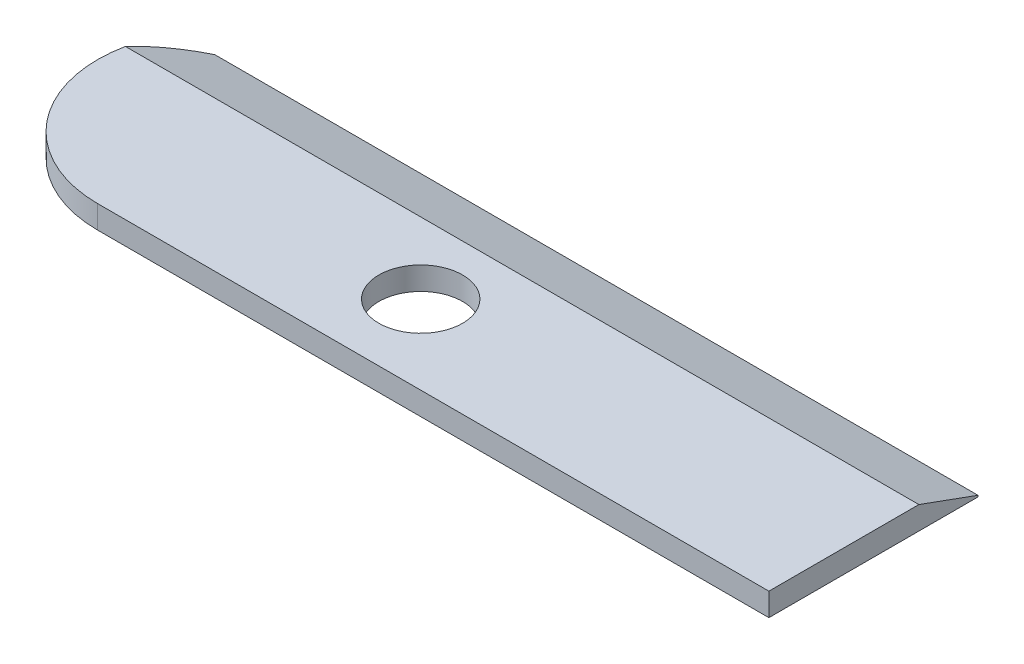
ISO-10303-21;
HEADER;
FILE_DESCRIPTION(('STEP AP214'),'2;1');
FILE_NAME('part.step','',(''),(''),'','','');
FILE_SCHEMA(('AUTOMOTIVE_DESIGN { 1 0 10303 214 1 1 1 1 }'));
ENDSEC;
DATA;
#1=APPLICATION_CONTEXT('core data for automotive mechanical design processes');
#2=APPLICATION_PROTOCOL_DEFINITION('international standard','automotive_design',2000,#1);
#3=PRODUCT_CONTEXT('',#1,'mechanical');
#4=PRODUCT('Part','Part','',(#3));
#5=PRODUCT_RELATED_PRODUCT_CATEGORY('part','',(#4));
#6=PRODUCT_DEFINITION_FORMATION('','',#4);
#7=PRODUCT_DEFINITION_CONTEXT('part definition',#1,'design');
#8=PRODUCT_DEFINITION('design','',#6,#7);
#9=PRODUCT_DEFINITION_SHAPE('','',#8);
#10=(LENGTH_UNIT() NAMED_UNIT(*) SI_UNIT(.MILLI.,.METRE.));
#11=(NAMED_UNIT(*) PLANE_ANGLE_UNIT() SI_UNIT($,.RADIAN.));
#12=(NAMED_UNIT(*) SI_UNIT($,.STERADIAN.) SOLID_ANGLE_UNIT());
#13=UNCERTAINTY_MEASURE_WITH_UNIT(LENGTH_MEASURE(1.E-05),#10,'distance_accuracy_value','');
#14=(GEOMETRIC_REPRESENTATION_CONTEXT(3) GLOBAL_UNCERTAINTY_ASSIGNED_CONTEXT((#13)) GLOBAL_UNIT_ASSIGNED_CONTEXT((#10,
#11,#12)) REPRESENTATION_CONTEXT('',''));
#15=CARTESIAN_POINT('',(0.,0.,0.));
#16=DIRECTION('',(0.,0.,1.));
#17=DIRECTION('',(1.,0.,0.));
#18=AXIS2_PLACEMENT_3D('',#15,#16,#17);
#19=CARTESIAN_POINT('',(-35.4774391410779,0.7,-18.245962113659));
#20=DIRECTION('',(0.,1.,0.));
#21=DIRECTION('',(0.,0.,1.));
#22=AXIS2_PLACEMENT_3D('',#19,#20,#21);
#23=PLANE('',#22);
#24=DIRECTION('',(0.,0.,-1.));
#25=VECTOR('',#24,1.);
#26=CARTESIAN_POINT('',(-15.0426007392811,0.7,-20.8124043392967));
#27=LINE('',#26,#25);
#28=CARTESIAN_POINT('',(-15.0426007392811,0.7,-14.445962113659));
#29=VERTEX_POINT('',#28);
#30=CARTESIAN_POINT('',(-15.0426007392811,0.7,-19.0124043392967));
#31=VERTEX_POINT('',#30);
#32=EDGE_CURVE('E95',#29,#31,#27,.T.);
#33=ORIENTED_EDGE('',*,*,#32,.T.);
#34=DIRECTION('',(-1.,0.,0.));
#35=VECTOR('',#34,1.);
#36=CARTESIAN_POINT('',(-38.2798263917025,0.7,-19.0124043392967));
#37=LINE('',#36,#35);
#38=CARTESIAN_POINT('',(-39.1993427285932,0.7,-19.0124043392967));
#39=VERTEX_POINT('',#38);
#40=EDGE_CURVE('E83',#31,#39,#37,.T.);
#41=ORIENTED_EDGE('',*,*,#40,.T.);
#42=CARTESIAN_POINT('',(-35.4774391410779,0.7,-18.245962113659));
#43=DIRECTION('',(0.,1.,0.));
#44=DIRECTION('',(0.,0.,1.));
#45=AXIS2_PLACEMENT_3D('',#42,#43,#44);
#46=CIRCLE('',#45,3.8);
#47=CARTESIAN_POINT('',(-35.4774391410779,0.7,-14.445962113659));
#48=VERTEX_POINT('',#47);
#49=EDGE_CURVE('E76',#39,#48,#46,.T.);
#50=ORIENTED_EDGE('',*,*,#49,.T.);
#51=DIRECTION('',(1.,0.,0.));
#52=VECTOR('',#51,1.);
#53=CARTESIAN_POINT('',(-35.4774391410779,0.7,-14.445962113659));
#54=LINE('',#53,#52);
#55=EDGE_CURVE('E80',#48,#29,#54,.T.);
#56=ORIENTED_EDGE('',*,*,#55,.T.);
#57=EDGE_LOOP('',(#33,#41,#50,#56));
#58=FACE_BOUND('',#57,.T.);
#59=CARTESIAN_POINT('',(-28.0426007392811,0.7,-16.845962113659));
#60=DIRECTION('',(0.,1.,0.));
#61=DIRECTION('',(0.,0.,1.));
#62=AXIS2_PLACEMENT_3D('',#59,#60,#61);
#63=CIRCLE('',#62,1.275);
#64=CARTESIAN_POINT('',(-28.0426007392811,0.7,-15.570962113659));
#65=VERTEX_POINT('',#64);
#66=EDGE_CURVE('E117',#65,#65,#63,.T.);
#67=ORIENTED_EDGE('',*,*,#66,.F.);
#68=EDGE_LOOP('',(#67));
#69=FACE_BOUND('',#68,.T.);
#70=ADVANCED_FACE('F32',(#58,#69),#23,.T.);
#71=CARTESIAN_POINT('',(-35.4774391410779,0.,-18.245962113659));
#72=DIRECTION('',(0.,1.,0.));
#73=DIRECTION('',(0.,0.,1.));
#74=AXIS2_PLACEMENT_3D('',#71,#72,#73);
#75=PLANE('',#74);
#76=CARTESIAN_POINT('',(-35.4774391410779,0.,-18.245962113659));
#77=DIRECTION('',(0.,1.,0.));
#78=DIRECTION('',(0.,0.,1.));
#79=AXIS2_PLACEMENT_3D('',#76,#77,#78);
#80=CIRCLE('',#79,3.8);
#81=CARTESIAN_POINT('',(-38.2798263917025,0.,-20.8124043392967));
#82=VERTEX_POINT('',#81);
#83=CARTESIAN_POINT('',(-35.4774391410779,0.,-14.445962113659));
#84=VERTEX_POINT('',#83);
#85=EDGE_CURVE('E99',#82,#84,#80,.T.);
#86=ORIENTED_EDGE('',*,*,#85,.F.);
#87=DIRECTION('',(-1.,0.,0.));
#88=VECTOR('',#87,1.);
#89=CARTESIAN_POINT('',(-15.0426007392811,0.,-20.8124043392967));
#90=LINE('',#89,#88);
#91=CARTESIAN_POINT('',(-15.0426007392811,0.,-20.8124043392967));
#92=VERTEX_POINT('',#91);
#93=EDGE_CURVE('E85',#92,#82,#90,.T.);
#94=ORIENTED_EDGE('',*,*,#93,.F.);
#95=DIRECTION('',(0.,0.,-1.));
#96=VECTOR('',#95,1.);
#97=CARTESIAN_POINT('',(-15.0426007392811,0.,-20.8124043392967));
#98=LINE('',#97,#96);
#99=CARTESIAN_POINT('',(-15.0426007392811,0.,-14.445962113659));
#100=VERTEX_POINT('',#99);
#101=EDGE_CURVE('E111',#100,#92,#98,.T.);
#102=ORIENTED_EDGE('',*,*,#101,.F.);
#103=DIRECTION('',(1.,0.,0.));
#104=VECTOR('',#103,1.);
#105=CARTESIAN_POINT('',(-35.4774391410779,0.,-14.445962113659));
#106=LINE('',#105,#104);
#107=EDGE_CURVE('E114',#84,#100,#106,.T.);
#108=ORIENTED_EDGE('',*,*,#107,.F.);
#109=EDGE_LOOP('',(#86,#94,#102,#108));
#110=FACE_BOUND('',#109,.T.);
#111=CARTESIAN_POINT('',(-28.0426007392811,0.,-16.845962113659));
#112=DIRECTION('',(0.,1.,0.));
#113=DIRECTION('',(0.,0.,1.));
#114=AXIS2_PLACEMENT_3D('',#111,#112,#113);
#115=CIRCLE('',#114,1.275);
#116=CARTESIAN_POINT('',(-28.0426007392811,0.,-15.570962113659));
#117=VERTEX_POINT('',#116);
#118=EDGE_CURVE('E119',#117,#117,#115,.T.);
#119=ORIENTED_EDGE('',*,*,#118,.T.);
#120=EDGE_LOOP('',(#119));
#121=FACE_BOUND('',#120,.T.);
#122=ADVANCED_FACE('F128',(#110,#121),#75,.F.);
#123=CARTESIAN_POINT('',(-35.4774391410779,0.7,-18.245962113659));
#124=DIRECTION('',(0.,-1.,0.));
#125=DIRECTION('',(0.,0.,-1.));
#126=AXIS2_PLACEMENT_3D('',#123,#124,#125);
#127=CYLINDRICAL_SURFACE('',#126,3.8);
#128=ORIENTED_EDGE('',*,*,#49,.F.);
#129=CARTESIAN_POINT('',(-35.4774391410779,0.97896215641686,-18.245962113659));
#130=DIRECTION('',(0.,0.939692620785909,-0.342020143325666));
#131=DIRECTION('',(0.,-0.342020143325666,-0.939692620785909));
#132=AXIS2_PLACEMENT_3D('',#129,#130,#131);
#133=ELLIPSE('',#132,4.04387553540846,3.8);
#134=CARTESIAN_POINT('',(-38.2798263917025,0.0448535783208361,-20.8124043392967));
#135=VERTEX_POINT('',#134);
#136=EDGE_CURVE('E54',#39,#135,#133,.F.);
#137=ORIENTED_EDGE('',*,*,#136,.T.);
#138=DIRECTION('',(0.,-1.,0.));
#139=VECTOR('',#138,1.);
#140=CARTESIAN_POINT('',(-38.2798263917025,0.7,-20.8124043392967));
#141=LINE('',#140,#139);
#142=EDGE_CURVE('E107',#135,#82,#141,.T.);
#143=ORIENTED_EDGE('',*,*,#142,.T.);
#144=ORIENTED_EDGE('',*,*,#85,.T.);
#145=DIRECTION('',(0.,-1.,0.));
#146=VECTOR('',#145,1.);
#147=CARTESIAN_POINT('',(-35.4774391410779,0.7,-14.445962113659));
#148=LINE('',#147,#146);
#149=EDGE_CURVE('E90',#48,#84,#148,.T.);
#150=ORIENTED_EDGE('',*,*,#149,.F.);
#151=EDGE_LOOP('',(#128,#137,#143,#144,#150));
#152=FACE_BOUND('',#151,.T.);
#153=ADVANCED_FACE('F97',(#152),#127,.T.);
#154=CARTESIAN_POINT('',(-35.4774391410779,0.7,-14.445962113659));
#155=DIRECTION('',(0.,0.,-1.));
#156=DIRECTION('',(-1.,0.,0.));
#157=AXIS2_PLACEMENT_3D('',#154,#155,#156);
#158=PLANE('',#157);
#159=ORIENTED_EDGE('',*,*,#107,.T.);
#160=DIRECTION('',(0.,-1.,0.));
#161=VECTOR('',#160,1.);
#162=CARTESIAN_POINT('',(-15.0426007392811,0.7,-14.445962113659));
#163=LINE('',#162,#161);
#164=EDGE_CURVE('E93',#29,#100,#163,.T.);
#165=ORIENTED_EDGE('',*,*,#164,.F.);
#166=ORIENTED_EDGE('',*,*,#55,.F.);
#167=ORIENTED_EDGE('',*,*,#149,.T.);
#168=EDGE_LOOP('',(#159,#165,#166,#167));
#169=FACE_BOUND('',#168,.T.);
#170=ADVANCED_FACE('F89',(#169),#158,.F.);
#171=CARTESIAN_POINT('',(-15.0426007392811,0.7,-20.8124043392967));
#172=DIRECTION('',(-1.,0.,0.));
#173=DIRECTION('',(0.,0.,1.));
#174=AXIS2_PLACEMENT_3D('',#171,#172,#173);
#175=PLANE('',#174);
#176=DIRECTION('',(0.,-1.,0.));
#177=VECTOR('',#176,1.);
#178=CARTESIAN_POINT('',(-15.0426007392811,0.7,-20.8124043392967));
#179=LINE('',#178,#177);
#180=CARTESIAN_POINT('',(-15.0426007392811,0.0448535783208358,-20.8124043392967));
#181=VERTEX_POINT('',#180);
#182=EDGE_CURVE('E102',#181,#92,#179,.T.);
#183=ORIENTED_EDGE('',*,*,#182,.F.);
#184=DIRECTION('',(0.,0.342020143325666,0.939692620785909));
#185=VECTOR('',#184,1.);
#186=CARTESIAN_POINT('',(-15.0426007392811,0.700000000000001,-19.0124043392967));
#187=LINE('',#186,#185);
#188=EDGE_CURVE('E11',#181,#31,#187,.T.);
#189=ORIENTED_EDGE('',*,*,#188,.T.);
#190=ORIENTED_EDGE('',*,*,#32,.F.);
#191=ORIENTED_EDGE('',*,*,#164,.T.);
#192=ORIENTED_EDGE('',*,*,#101,.T.);
#193=EDGE_LOOP('',(#183,#189,#190,#191,#192));
#194=FACE_BOUND('',#193,.T.);
#195=ADVANCED_FACE('F140',(#194),#175,.F.);
#196=CARTESIAN_POINT('',(-15.0426007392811,0.7,-20.8124043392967));
#197=DIRECTION('',(0.,0.,1.));
#198=DIRECTION('',(1.,0.,0.));
#199=AXIS2_PLACEMENT_3D('',#196,#197,#198);
#200=PLANE('',#199);
#201=ORIENTED_EDGE('',*,*,#142,.F.);
#202=DIRECTION('',(1.,0.,0.));
#203=VECTOR('',#202,1.);
#204=CARTESIAN_POINT('',(-15.0426007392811,0.044853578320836,-20.8124043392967));
#205=LINE('',#204,#203);
#206=EDGE_CURVE('E40',#135,#181,#205,.T.);
#207=ORIENTED_EDGE('',*,*,#206,.T.);
#208=ORIENTED_EDGE('',*,*,#182,.T.);
#209=ORIENTED_EDGE('',*,*,#93,.T.);
#210=EDGE_LOOP('',(#201,#207,#208,#209));
#211=FACE_BOUND('',#210,.T.);
#212=ADVANCED_FACE('F137',(#211),#200,.F.);
#213=CARTESIAN_POINT('',(-28.0426007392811,0.7,-16.845962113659));
#214=DIRECTION('',(0.,-1.,0.));
#215=DIRECTION('',(0.,0.,-1.));
#216=AXIS2_PLACEMENT_3D('',#213,#214,#215);
#217=CYLINDRICAL_SURFACE('',#216,1.275);
#218=ORIENTED_EDGE('',*,*,#66,.T.);
#219=EDGE_LOOP('',(#218));
#220=FACE_BOUND('',#219,.T.);
#221=ORIENTED_EDGE('',*,*,#118,.F.);
#222=EDGE_LOOP('',(#221));
#223=FACE_BOUND('',#222,.T.);
#224=ADVANCED_FACE('F125',(#220,#223),#217,.F.);
#225=CARTESIAN_POINT('',(-35.4774391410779,0.7,-19.0124043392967));
#226=DIRECTION('',(0.,0.939692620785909,-0.342020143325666));
#227=DIRECTION('',(0.,0.342020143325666,0.939692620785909));
#228=AXIS2_PLACEMENT_3D('',#225,#226,#227);
#229=PLANE('',#228);
#230=ORIENTED_EDGE('',*,*,#188,.F.);
#231=ORIENTED_EDGE('',*,*,#206,.F.);
#232=ORIENTED_EDGE('',*,*,#136,.F.);
#233=ORIENTED_EDGE('',*,*,#40,.F.);
#234=EDGE_LOOP('',(#230,#231,#232,#233));
#235=FACE_BOUND('',#234,.T.);
#236=ADVANCED_FACE('F34',(#235),#229,.T.);
#237=CLOSED_SHELL('',(#70,#122,#153,#170,#195,#212,#224,#236));
#238=MANIFOLD_SOLID_BREP('B2',#237);
#239=ADVANCED_BREP_SHAPE_REPRESENTATION('',(#18,#238),#14);
#240=SHAPE_DEFINITION_REPRESENTATION(#9,#239);
ENDSEC;
END-ISO-10303-21;
